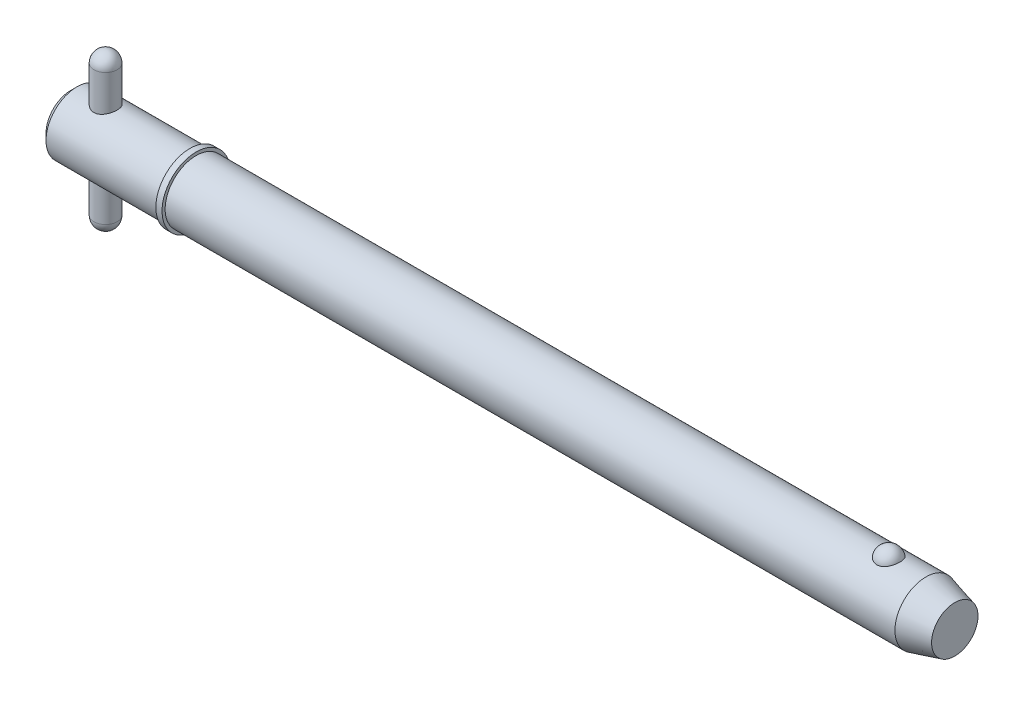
ISO-10303-21;
HEADER;
FILE_DESCRIPTION(('STEP AP214'),'2;1');
FILE_NAME('part.step','',(''),(''),'','','');
FILE_SCHEMA(('AUTOMOTIVE_DESIGN { 1 0 10303 214 1 1 1 1 }'));
ENDSEC;
DATA;
#1=APPLICATION_CONTEXT('core data for automotive mechanical design processes');
#2=APPLICATION_PROTOCOL_DEFINITION('international standard','automotive_design',2000,#1);
#3=PRODUCT_CONTEXT('',#1,'mechanical');
#4=PRODUCT('Part','Part','',(#3));
#5=PRODUCT_RELATED_PRODUCT_CATEGORY('part','',(#4));
#6=PRODUCT_DEFINITION_FORMATION('','',#4);
#7=PRODUCT_DEFINITION_CONTEXT('part definition',#1,'design');
#8=PRODUCT_DEFINITION('design','',#6,#7);
#9=PRODUCT_DEFINITION_SHAPE('','',#8);
#10=(LENGTH_UNIT() NAMED_UNIT(*) SI_UNIT(.MILLI.,.METRE.));
#11=(NAMED_UNIT(*) PLANE_ANGLE_UNIT() SI_UNIT($,.RADIAN.));
#12=(NAMED_UNIT(*) SI_UNIT($,.STERADIAN.) SOLID_ANGLE_UNIT());
#13=UNCERTAINTY_MEASURE_WITH_UNIT(LENGTH_MEASURE(1.E-05),#10,'distance_accuracy_value','');
#14=(GEOMETRIC_REPRESENTATION_CONTEXT(3) GLOBAL_UNCERTAINTY_ASSIGNED_CONTEXT((#13)) GLOBAL_UNIT_ASSIGNED_CONTEXT((#10,
#11,#12)) REPRESENTATION_CONTEXT('',''));
#15=CARTESIAN_POINT('',(0.,0.,0.));
#16=DIRECTION('',(0.,0.,1.));
#17=DIRECTION('',(1.,0.,0.));
#18=AXIS2_PLACEMENT_3D('',#15,#16,#17);
#19=CARTESIAN_POINT('',(7.14,15.875,0.));
#20=DIRECTION('',(0.,-1.,0.));
#21=DIRECTION('',(0.,0.,-1.));
#22=AXIS2_PLACEMENT_3D('',#19,#20,#21);
#23=CYLINDRICAL_SURFACE('',#22,2.38);
#24=CARTESIAN_POINT('',(7.14,-13.495,0.));
#25=DIRECTION('',(0.,-1.,0.));
#26=DIRECTION('',(0.,0.,-1.));
#27=AXIS2_PLACEMENT_3D('',#24,#25,#26);
#28=CIRCLE('',#27,2.38);
#29=CARTESIAN_POINT('',(7.14,-13.495,-2.38));
#30=VERTEX_POINT('',#29);
#31=EDGE_CURVE('P0_E10',#30,#30,#28,.F.);
#32=ORIENTED_EDGE('',*,*,#31,.T.);
#33=EDGE_LOOP('',(#32));
#34=FACE_BOUND('',#33,.T.);
#35=CARTESIAN_POINT('',(7.14,13.495,0.));
#36=DIRECTION('',(0.,-1.,0.));
#37=DIRECTION('',(0.,0.,-1.));
#38=AXIS2_PLACEMENT_3D('',#35,#36,#37);
#39=CIRCLE('',#38,2.38);
#40=CARTESIAN_POINT('',(7.14,13.495,-2.38));
#41=VERTEX_POINT('',#40);
#42=EDGE_CURVE('P0_E21',#41,#41,#39,.T.);
#43=ORIENTED_EDGE('',*,*,#42,.T.);
#44=EDGE_LOOP('',(#43));
#45=FACE_BOUND('',#44,.T.);
#46=ADVANCED_FACE('P0_F14',(#34,#45),#23,.T.);
#47=CARTESIAN_POINT('',(7.14,-13.495,0.));
#48=DIRECTION('',(0.,0.,1.));
#49=DIRECTION('',(1.,0.,0.));
#50=AXIS2_PLACEMENT_3D('',#47,#48,#49);
#51=SPHERICAL_SURFACE('',#50,2.38);
#52=CARTESIAN_POINT('',(7.14,-13.495,0.));
#53=DIRECTION('',(0.,-1.,0.));
#54=DIRECTION('',(0.,0.,-1.));
#55=AXIS2_PLACEMENT_3D('',#52,#53,#54);
#56=SPHERICAL_SURFACE('',#55,2.38);
#57=ORIENTED_EDGE('',*,*,#31,.F.);
#58=EDGE_LOOP('',(#57));
#59=FACE_BOUND('',#58,.T.);
#60=ADVANCED_FACE('P0_F29',(#59),#56,.T.);
#61=CARTESIAN_POINT('',(7.14,13.495,0.));
#62=DIRECTION('',(0.,0.,1.));
#63=DIRECTION('',(1.,0.,0.));
#64=AXIS2_PLACEMENT_3D('',#61,#62,#63);
#65=SPHERICAL_SURFACE('',#64,2.38);
#66=CARTESIAN_POINT('',(7.14,13.495,0.));
#67=DIRECTION('',(0.,-1.,0.));
#68=DIRECTION('',(0.,0.,-1.));
#69=AXIS2_PLACEMENT_3D('',#66,#67,#68);
#70=SPHERICAL_SURFACE('',#69,2.38);
#71=ORIENTED_EDGE('',*,*,#42,.F.);
#72=EDGE_LOOP('',(#71));
#73=FACE_BOUND('',#72,.T.);
#74=ADVANCED_FACE('P0_F16',(#73),#70,.T.);
#75=CLOSED_SHELL('',(#46,#60,#74));
#76=MANIFOLD_SOLID_BREP('P0_B1',#75);
#77=CARTESIAN_POINT('',(0.,0.,0.));
#78=DIRECTION('',(1.,0.,0.));
#79=DIRECTION('',(0.,0.,-1.));
#80=AXIS2_PLACEMENT_3D('',#77,#78,#79);
#81=CYLINDRICAL_SURFACE('',#80,6.35);
#82=CARTESIAN_POINT('',(175.355369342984,0.,0.));
#83=DIRECTION('',(1.,0.,0.));
#84=DIRECTION('',(0.,0.,-1.));
#85=AXIS2_PLACEMENT_3D('',#82,#83,#84);
#86=CIRCLE('',#85,6.35);
#87=CARTESIAN_POINT('',(175.355369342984,0.,-6.35));
#88=VERTEX_POINT('',#87);
#89=EDGE_CURVE('P1_E81',#88,#88,#86,.T.);
#90=ORIENTED_EDGE('',*,*,#89,.F.);
#91=EDGE_LOOP('',(#90));
#92=FACE_BOUND('',#91,.T.);
#93=CARTESIAN_POINT('',(25.7,0.,0.));
#94=DIRECTION('',(1.,0.,0.));
#95=DIRECTION('',(0.,0.,-1.));
#96=AXIS2_PLACEMENT_3D('',#93,#94,#95);
#97=CIRCLE('',#96,6.35);
#98=CARTESIAN_POINT('',(25.7,0.,-6.35));
#99=VERTEX_POINT('',#98);
#100=EDGE_CURVE('P1_E85',#99,#99,#97,.T.);
#101=ORIENTED_EDGE('',*,*,#100,.T.);
#102=EDGE_LOOP('',(#101));
#103=FACE_BOUND('',#102,.T.);
#104=CARTESIAN_POINT('',(167.730021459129,5.87502187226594,2.40969251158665));
#105=CARTESIAN_POINT('',(167.605030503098,5.87501645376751,2.40969773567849));
#106=CARTESIAN_POINT('',(167.480080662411,5.87916061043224,2.39967292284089));
#107=CARTESIAN_POINT('',(167.233909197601,5.89523112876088,2.35991730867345));
#108=CARTESIAN_POINT('',(167.112686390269,5.90715499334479,2.33019283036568));
#109=CARTESIAN_POINT('',(166.877517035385,5.93739567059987,2.25201402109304));
#110=CARTESIAN_POINT('',(166.763560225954,5.95570321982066,2.20358681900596));
#111=CARTESIAN_POINT('',(166.54557352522,5.99672067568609,2.08937987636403));
#112=CARTESIAN_POINT('',(166.441545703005,6.0194314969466,2.02359652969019));
#113=CARTESIAN_POINT('',(166.242943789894,6.06760647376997,1.87428969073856));
#114=CARTESIAN_POINT('',(166.148726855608,6.09313095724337,1.79031110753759));
#115=CARTESIAN_POINT('',(165.975255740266,6.14375873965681,1.6080017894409));
#116=CARTESIAN_POINT('',(165.896004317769,6.16886196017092,1.50966841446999));
#117=CARTESIAN_POINT('',(165.750845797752,6.21724600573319,1.29645884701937));
#118=CARTESIAN_POINT('',(165.685688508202,6.24039621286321,1.18104158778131));
#119=CARTESIAN_POINT('',(165.574703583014,6.28117277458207,0.940351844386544));
#120=CARTESIAN_POINT('',(165.528877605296,6.29879865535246,0.815078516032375));
#121=CARTESIAN_POINT('',(165.457023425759,6.32692073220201,0.556494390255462));
#122=CARTESIAN_POINT('',(165.431249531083,6.33732517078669,0.423102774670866));
#123=CARTESIAN_POINT('',(165.400988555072,6.34957673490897,0.153542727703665));
#124=CARTESIAN_POINT('',(165.396500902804,6.35142408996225,0.0173743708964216));
#125=CARTESIAN_POINT('',(165.408865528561,6.34638925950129,-0.253036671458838));
#126=CARTESIAN_POINT('',(165.425594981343,6.33955731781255,-0.387285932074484));
#127=CARTESIAN_POINT('',(165.479843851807,6.31794129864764,-0.650851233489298));
#128=CARTESIAN_POINT('',(165.517363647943,6.3031570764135,-0.780167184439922));
#129=CARTESIAN_POINT('',(165.612500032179,6.26711642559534,-1.03041949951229));
#130=CARTESIAN_POINT('',(165.670143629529,6.24585130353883,-1.15134433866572));
#131=CARTESIAN_POINT('',(165.804352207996,6.19905619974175,-1.38129800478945));
#132=CARTESIAN_POINT('',(165.880918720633,6.17352587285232,-1.49032586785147));
#133=CARTESIAN_POINT('',(166.051753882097,6.12080227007,-1.69393164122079));
#134=CARTESIAN_POINT('',(166.146100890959,6.09360200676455,-1.78844209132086));
#135=CARTESIAN_POINT('',(166.350119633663,6.04070434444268,-1.95970536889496));
#136=CARTESIAN_POINT('',(166.459790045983,6.015006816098,-2.0364597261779));
#137=CARTESIAN_POINT('',(166.689187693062,5.96867714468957,-2.16845644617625));
#138=CARTESIAN_POINT('',(166.808652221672,5.94794910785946,-2.22412062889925));
#139=CARTESIAN_POINT('',(167.056218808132,5.91340580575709,-2.31440992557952));
#140=CARTESIAN_POINT('',(167.184317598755,5.89958794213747,-2.34904294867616));
#141=CARTESIAN_POINT('',(167.438582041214,5.88111049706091,-2.39491590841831));
#142=CARTESIAN_POINT('',(167.564520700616,5.87602512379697,-2.40724512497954));
#143=CARTESIAN_POINT('',(167.816786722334,5.87428980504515,-2.41147867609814));
#144=CARTESIAN_POINT('',(167.943114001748,5.8776381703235,-2.40338710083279));
#145=CARTESIAN_POINT('',(168.188417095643,5.89212921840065,-2.36762715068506));
#146=CARTESIAN_POINT('',(168.307499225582,5.90302431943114,-2.3405803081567));
#147=CARTESIAN_POINT('',(168.53924472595,5.93113752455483,-2.26839066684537));
#148=CARTESIAN_POINT('',(168.651907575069,5.94835614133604,-2.22324640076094));
#149=CARTESIAN_POINT('',(168.870400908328,5.9877301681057,-2.11493806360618));
#150=CARTESIAN_POINT('',(168.976028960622,6.00998499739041,-2.05140269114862));
#151=CARTESIAN_POINT('',(169.175300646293,6.05690144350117,-1.90842705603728));
#152=CARTESIAN_POINT('',(169.268941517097,6.08156361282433,-1.82898313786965));
#153=CARTESIAN_POINT('',(169.446675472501,6.13211715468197,-1.65182429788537));
#154=CARTESIAN_POINT('',(169.530055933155,6.15800825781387,-1.5533938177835));
#155=CARTESIAN_POINT('',(169.679790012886,6.20712834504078,-1.34374214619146));
#156=CARTESIAN_POINT('',(169.746140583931,6.23035685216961,-1.23251867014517));
#157=CARTESIAN_POINT('',(169.862345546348,6.27251177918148,-0.996447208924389));
#158=CARTESIAN_POINT('',(169.911607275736,6.29127762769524,-0.871278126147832));
#159=CARTESIAN_POINT('',(169.989614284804,6.3215862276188,-0.613870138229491));
#160=CARTESIAN_POINT('',(170.018359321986,6.33312889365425,-0.481631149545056));
#161=CARTESIAN_POINT('',(170.05477058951,6.34782349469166,-0.213672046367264));
#162=CARTESIAN_POINT('',(170.062413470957,6.35096613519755,-0.0779482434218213));
#163=CARTESIAN_POINT('',(170.056395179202,6.34851322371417,0.192943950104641));
#164=CARTESIAN_POINT('',(170.042734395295,6.3429178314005,0.328112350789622));
#165=CARTESIAN_POINT('',(169.99450361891,6.32360512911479,0.593406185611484));
#166=CARTESIAN_POINT('',(169.960031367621,6.30992579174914,0.723552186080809));
#167=CARTESIAN_POINT('',(169.870953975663,6.27586325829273,0.97583417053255));
#168=CARTESIAN_POINT('',(169.81634761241,6.25547965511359,1.09796966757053));
#169=CARTESIAN_POINT('',(169.68775879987,6.20998183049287,1.33148921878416));
#170=CARTESIAN_POINT('',(169.613674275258,6.18484288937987,1.44281227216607));
#171=CARTESIAN_POINT('',(169.447820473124,6.13258735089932,1.65087683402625));
#172=CARTESIAN_POINT('',(169.356051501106,6.10547078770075,1.7476185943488));
#173=CARTESIAN_POINT('',(169.157183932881,6.05235879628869,1.92350926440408));
#174=CARTESIAN_POINT('',(169.050133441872,6.02636017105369,2.00271146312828));
#175=CARTESIAN_POINT('',(168.823138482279,5.97843747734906,2.14154159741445));
#176=CARTESIAN_POINT('',(168.703191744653,5.9565141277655,2.20116608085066));
#177=CARTESIAN_POINT('',(168.444523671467,5.91812106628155,2.30250570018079));
#178=CARTESIAN_POINT('',(168.30506980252,5.90217533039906,2.34256795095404));
#179=CARTESIAN_POINT('',(168.020397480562,5.88063128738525,2.3961521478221));
#180=CARTESIAN_POINT('',(167.87518174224,5.87502816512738,2.40968644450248));
#181=CARTESIAN_POINT('',(167.730021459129,5.87502187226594,2.40969251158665));
#182=B_SPLINE_CURVE_WITH_KNOTS('',3,(#104,#105,#106,#107,#108,#109,#110,#111,#112,#113,#114,
#115,#116,#117,#118,#119,#120,#121,#122,#123,#124,#125,#126,#127,#128,#129,#130,#131,#132,#133,
#134,#135,#136,#137,#138,#139,#140,#141,#142,#143,#144,#145,#146,#147,#148,#149,#150,#151,#152,
#153,#154,#155,#156,#157,#158,#159,#160,#161,#162,#163,#164,#165,#166,#167,#168,#169,#170,#171,
#172,#173,#174,#175,#176,#177,#178,#179,#180,#181),.UNSPECIFIED.,.T.,.F.,(4,2,2,2,2,2,2,2,2,2,2,
2,2,2,2,2,2,2,2,2,2,2,2,2,2,2,2,2,2,2,2,2,2,2,2,2,2,2,4),(0.,0.374440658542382,
0.748761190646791,1.122540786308,1.4963981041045,1.88098871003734,2.26565013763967,
2.66741104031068,3.06920639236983,3.47601794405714,3.88281858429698,4.28727498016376,
4.69173873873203,5.09674745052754,5.50178895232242,5.90865911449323,6.31549420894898,
6.71369855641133,7.11175305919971,7.48978077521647,7.86773278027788,8.23383886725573,
8.59997464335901,8.97409044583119,9.34829231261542,9.74122667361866,10.1342313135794,
10.5397522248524,10.9452779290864,11.3512521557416,11.75721896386,12.1612938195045,
12.5653932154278,12.9716540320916,13.3779078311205,13.7829098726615,14.1879832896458,
14.6230486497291,15.0579114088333),.UNSPECIFIED.);
#183=CARTESIAN_POINT('',(167.730021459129,5.87502187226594,2.40969251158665));
#184=VERTEX_POINT('',#183);
#185=EDGE_CURVE('P1_E35',#184,#184,#182,.T.);
#186=ORIENTED_EDGE('',*,*,#185,.T.);
#187=EDGE_LOOP('',(#186));
#188=FACE_BOUND('',#187,.T.);
#189=ADVANCED_FACE('P1_F13',(#92,#103,#188),#81,.T.);
#190=CARTESIAN_POINT('',(0.,0.,0.));
#191=DIRECTION('',(-1.,0.,0.));
#192=DIRECTION('',(0.,0.,1.));
#193=AXIS2_PLACEMENT_3D('',#190,#191,#192);
#194=PLANE('',#193);
#195=CARTESIAN_POINT('',(0.,0.,0.));
#196=DIRECTION('',(1.,0.,0.));
#197=DIRECTION('',(0.,0.,-1.));
#198=AXIS2_PLACEMENT_3D('',#195,#196,#197);
#199=CIRCLE('',#198,5.08);
#200=CARTESIAN_POINT('',(0.,0.,-5.08));
#201=VERTEX_POINT('',#200);
#202=EDGE_CURVE('P1_E9',#201,#201,#199,.T.);
#203=ORIENTED_EDGE('',*,*,#202,.F.);
#204=EDGE_LOOP('',(#203));
#205=FACE_BOUND('',#204,.T.);
#206=ADVANCED_FACE('P1_F15',(#205),#194,.T.);
#207=CARTESIAN_POINT('',(1.27,0.,0.));
#208=DIRECTION('',(1.,0.,0.));
#209=DIRECTION('',(0.,0.,-1.));
#210=AXIS2_PLACEMENT_3D('',#207,#208,#209);
#211=CONICAL_SURFACE('',#210,6.35,0.78539816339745);
#212=ORIENTED_EDGE('',*,*,#202,.T.);
#213=EDGE_LOOP('',(#212));
#214=FACE_BOUND('',#213,.T.);
#215=CARTESIAN_POINT('',(1.27,0.,0.));
#216=DIRECTION('',(1.,0.,0.));
#217=DIRECTION('',(0.,0.,-1.));
#218=AXIS2_PLACEMENT_3D('',#215,#216,#217);
#219=CIRCLE('',#218,6.35);
#220=CARTESIAN_POINT('',(1.27,0.,-6.35));
#221=VERTEX_POINT('',#220);
#222=EDGE_CURVE('P1_E26',#221,#221,#219,.T.);
#223=ORIENTED_EDGE('',*,*,#222,.F.);
#224=EDGE_LOOP('',(#223));
#225=FACE_BOUND('',#224,.T.);
#226=ADVANCED_FACE('P1_F77',(#214,#225),#211,.T.);
#227=CARTESIAN_POINT('',(0.,0.,0.));
#228=DIRECTION('',(1.,0.,0.));
#229=DIRECTION('',(0.,0.,-1.));
#230=AXIS2_PLACEMENT_3D('',#227,#228,#229);
#231=CYLINDRICAL_SURFACE('',#230,6.35);
#232=CARTESIAN_POINT('',(7.14,-5.88711304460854,2.38));
#233=CARTESIAN_POINT('',(7.01146258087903,-5.88710856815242,2.38000480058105));
#234=CARTESIAN_POINT('',(6.88295682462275,-5.89136840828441,2.36955244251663));
#235=CARTESIAN_POINT('',(6.62981934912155,-5.90782785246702,2.32820953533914));
#236=CARTESIAN_POINT('',(6.50518751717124,-5.92002722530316,2.29731958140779));
#237=CARTESIAN_POINT('',(6.26352403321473,-5.95079384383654,2.21639366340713));
#238=CARTESIAN_POINT('',(6.14647496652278,-5.96934583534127,2.16640353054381));
#239=CARTESIAN_POINT('',(5.92237941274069,-6.01070278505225,2.04885862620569));
#240=CARTESIAN_POINT('',(5.81533593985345,-6.03350901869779,1.98129858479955));
#241=CARTESIAN_POINT('',(5.60897525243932,-6.08207341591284,1.82693902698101));
#242=CARTESIAN_POINT('',(5.51022503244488,-6.10791836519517,1.73940861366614));
#243=CARTESIAN_POINT('',(5.32840561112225,-6.15892405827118,1.54914379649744));
#244=CARTESIAN_POINT('',(5.24533975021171,-6.1840846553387,1.44640616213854));
#245=CARTESIAN_POINT('',(5.09451639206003,-6.23191821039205,1.22434014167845));
#246=CARTESIAN_POINT('',(5.02737511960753,-6.25447755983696,1.10456656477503));
#247=CARTESIAN_POINT('',(4.91443001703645,-6.2935236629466,0.854429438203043));
#248=CARTESIAN_POINT('',(4.86861879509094,-6.31001251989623,0.724069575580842));
#249=CARTESIAN_POINT('',(4.80162253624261,-6.33444370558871,0.46242122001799));
#250=CARTESIAN_POINT('',(4.77946137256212,-6.34272370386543,0.331414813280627));
#251=CARTESIAN_POINT('',(4.75726677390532,-6.35101600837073,0.0672982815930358));
#252=CARTESIAN_POINT('',(4.75722615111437,-6.35103100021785,-0.0658111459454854));
#253=CARTESIAN_POINT('',(4.77870510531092,-6.3430064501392,-0.323358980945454));
#254=CARTESIAN_POINT('',(4.79915922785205,-6.33536494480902,-0.447900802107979));
#255=CARTESIAN_POINT('',(4.85925493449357,-6.31340794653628,-0.69163609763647));
#256=CARTESIAN_POINT('',(4.89889787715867,-6.29909198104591,-0.810829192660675));
#257=CARTESIAN_POINT('',(4.9967414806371,-6.26494471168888,-1.04254212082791));
#258=CARTESIAN_POINT('',(5.05520370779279,-6.24503620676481,-1.1549396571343));
#259=CARTESIAN_POINT('',(5.1887948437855,-6.20171869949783,-1.3686079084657));
#260=CARTESIAN_POINT('',(5.26392912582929,-6.17830856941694,-1.46987502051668));
#261=CARTESIAN_POINT('',(5.43386591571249,-6.12878580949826,-1.66468415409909));
#262=CARTESIAN_POINT('',(5.52956139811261,-6.10259519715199,-1.75742857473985));
#263=CARTESIAN_POINT('',(5.73530435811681,-6.05155777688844,-1.92585331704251));
#264=CARTESIAN_POINT('',(5.84535542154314,-6.02671130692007,-2.00152936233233));
#265=CARTESIAN_POINT('',(6.07982989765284,-5.98068420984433,-2.13519109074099));
#266=CARTESIAN_POINT('',(6.20451768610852,-5.95959698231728,-2.19274775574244));
#267=CARTESIAN_POINT('',(6.4628145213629,-5.92455622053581,-2.28574558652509));
#268=CARTESIAN_POINT('',(6.59641856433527,-5.91059872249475,-2.32119904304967));
#269=CARTESIAN_POINT('',(6.86087441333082,-5.8923327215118,-2.36717069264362));
#270=CARTESIAN_POINT('',(6.99147192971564,-5.8875347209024,-2.37895573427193));
#271=CARTESIAN_POINT('',(7.25283805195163,-5.88674545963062,-2.38091046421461));
#272=CARTESIAN_POINT('',(7.38360660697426,-5.89075200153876,-2.37108554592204));
#273=CARTESIAN_POINT('',(7.63510696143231,-5.90662331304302,-2.33124781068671));
#274=CARTESIAN_POINT('',(7.75602069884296,-5.91810660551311,-2.30221396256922));
#275=CARTESIAN_POINT('',(7.99120505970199,-5.94718527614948,-2.22601401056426));
#276=CARTESIAN_POINT('',(8.10547431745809,-5.96478190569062,-2.17884419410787));
#277=CARTESIAN_POINT('',(8.32888632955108,-6.00491533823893,-2.06572311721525));
#278=CARTESIAN_POINT('',(8.43767672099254,-6.02761250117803,-1.99913452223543));
#279=CARTESIAN_POINT('',(8.6429894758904,-6.07511988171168,-1.84974438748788));
#280=CARTESIAN_POINT('',(8.73950733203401,-6.09993087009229,-1.76693691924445));
#281=CARTESIAN_POINT('',(8.9238741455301,-6.1507686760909,-1.58125563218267));
#282=CARTESIAN_POINT('',(9.01078732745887,-6.17677301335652,-1.47744327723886));
#283=CARTESIAN_POINT('',(9.16607127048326,-6.22556172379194,-1.25606967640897));
#284=CARTESIAN_POINT('',(9.23444197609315,-6.24834608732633,-1.13850838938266));
#285=CARTESIAN_POINT('',(9.3502493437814,-6.28811144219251,-0.893050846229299));
#286=CARTESIAN_POINT('',(9.39775808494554,-6.30511236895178,-0.765192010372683));
#287=CARTESIAN_POINT('',(9.47032640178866,-6.33145833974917,-0.502514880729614));
#288=CARTESIAN_POINT('',(9.49539651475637,-6.34080697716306,-0.367699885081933));
#289=CARTESIAN_POINT('',(9.52124059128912,-6.35045496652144,-0.103396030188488));
#290=CARTESIAN_POINT('',(9.52334421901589,-6.35124952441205,0.025945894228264));
#291=CARTESIAN_POINT('',(9.50661518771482,-6.34499064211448,0.283061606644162));
#292=CARTESIAN_POINT('',(9.48778504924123,-6.33793814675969,0.410835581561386));
#293=CARTESIAN_POINT('',(9.43065630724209,-6.31700307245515,0.658028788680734));
#294=CARTESIAN_POINT('',(9.39284291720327,-6.30329098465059,0.7775756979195));
#295=CARTESIAN_POINT('',(9.29930406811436,-6.27046903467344,1.00863789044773));
#296=CARTESIAN_POINT('',(9.2435752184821,-6.25135815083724,1.12015164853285));
#297=CARTESIAN_POINT('',(9.11312349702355,-6.20865254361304,1.33711407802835));
#298=CARTESIAN_POINT('',(9.03770094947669,-6.18490316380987,1.44211105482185));
#299=CARTESIAN_POINT('',(8.87110640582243,-6.13583718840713,1.63836897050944));
#300=CARTESIAN_POINT('',(8.77992879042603,-6.11052003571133,1.72962498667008));
#301=CARTESIAN_POINT('',(8.57869799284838,-6.05953829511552,1.90076098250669));
#302=CARTESIAN_POINT('',(8.46790320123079,-6.03392573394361,1.97978778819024));
#303=CARTESIAN_POINT('',(8.23379693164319,-5.98676607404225,2.11813466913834));
#304=CARTESIAN_POINT('',(8.11048418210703,-5.9652193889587,2.17745273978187));
#305=CARTESIAN_POINT('',(7.84900037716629,-5.92818393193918,2.27641807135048));
#306=CARTESIAN_POINT('',(7.71041678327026,-5.91299857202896,2.31510015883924));
#307=CARTESIAN_POINT('',(7.42787316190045,-5.89246887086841,2.36688002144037));
#308=CARTESIAN_POINT('',(7.28391673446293,-5.88711805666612,2.37999462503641));
#309=CARTESIAN_POINT('',(7.14,-5.88711304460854,2.38));
#310=B_SPLINE_CURVE_WITH_KNOTS('',3,(#232,#233,#234,#235,#236,#237,#238,#239,#240,#241,#242,
#243,#244,#245,#246,#247,#248,#249,#250,#251,#252,#253,#254,#255,#256,#257,#258,#259,#260,#261,
#262,#263,#264,#265,#266,#267,#268,#269,#270,#271,#272,#273,#274,#275,#276,#277,#278,#279,#280,
#281,#282,#283,#284,#285,#286,#287,#288,#289,#290,#291,#292,#293,#294,#295,#296,#297,#298,#299,
#300,#301,#302,#303,#304,#305,#306,#307,#308,#309),.UNSPECIFIED.,.T.,.F.,(4,2,2,2,2,2,2,2,2,2,2,
2,2,2,2,2,2,2,2,2,2,2,2,2,2,2,2,2,2,2,2,2,2,2,2,2,2,2,4),(0.,0.385076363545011,
0.770141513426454,1.15428843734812,1.53855071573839,1.94016118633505,2.3418570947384,
2.75720522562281,3.1724093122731,3.569721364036,3.96690431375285,4.34445758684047,
4.72203759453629,5.10511017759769,5.48830640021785,5.89390240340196,6.29959991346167,
6.71428455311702,7.12873839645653,7.52034494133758,7.91185376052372,8.28480528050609,
8.65783318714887,9.0448340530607,9.43197664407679,9.84363087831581,10.2552863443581,
10.6655081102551,11.0755371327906,11.4616919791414,11.847800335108,12.224507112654,
12.6012852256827,12.9938941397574,13.386643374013,13.8000944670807,14.2135876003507,
14.6450218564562,15.0761720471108),.UNSPECIFIED.);
#311=CARTESIAN_POINT('',(7.14,-5.88711304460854,2.38));
#312=VERTEX_POINT('',#311);
#313=EDGE_CURVE('P1_E17',#312,#312,#310,.T.);
#314=ORIENTED_EDGE('',*,*,#313,.F.);
#315=EDGE_LOOP('',(#314));
#316=FACE_BOUND('',#315,.T.);
#317=CARTESIAN_POINT('',(7.14,5.88711304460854,2.38));
#318=CARTESIAN_POINT('',(7.26853741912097,5.88710856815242,2.38000480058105));
#319=CARTESIAN_POINT('',(7.39704317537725,5.89136840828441,2.36955244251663));
#320=CARTESIAN_POINT('',(7.65018065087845,5.90782785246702,2.32820953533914));
#321=CARTESIAN_POINT('',(7.77481248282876,5.92002722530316,2.29731958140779));
#322=CARTESIAN_POINT('',(8.01647596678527,5.95079384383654,2.21639366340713));
#323=CARTESIAN_POINT('',(8.13352503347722,5.96934583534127,2.16640353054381));
#324=CARTESIAN_POINT('',(8.35762058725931,6.01070278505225,2.04885862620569));
#325=CARTESIAN_POINT('',(8.46466406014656,6.03350901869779,1.98129858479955));
#326=CARTESIAN_POINT('',(8.67102474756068,6.08207341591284,1.82693902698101));
#327=CARTESIAN_POINT('',(8.76977496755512,6.10791836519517,1.73940861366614));
#328=CARTESIAN_POINT('',(8.95159438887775,6.15892405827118,1.54914379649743));
#329=CARTESIAN_POINT('',(9.03466024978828,6.1840846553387,1.44640616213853));
#330=CARTESIAN_POINT('',(9.18548360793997,6.23191821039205,1.22434014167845));
#331=CARTESIAN_POINT('',(9.25262488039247,6.25447755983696,1.10456656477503));
#332=CARTESIAN_POINT('',(9.36556998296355,6.2935236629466,0.854429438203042));
#333=CARTESIAN_POINT('',(9.41138120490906,6.31001251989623,0.72406957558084));
#334=CARTESIAN_POINT('',(9.47837746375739,6.33444370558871,0.462421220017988));
#335=CARTESIAN_POINT('',(9.50053862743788,6.34272370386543,0.331414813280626));
#336=CARTESIAN_POINT('',(9.52273322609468,6.35101600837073,0.0672982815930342));
#337=CARTESIAN_POINT('',(9.52277384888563,6.35103100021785,-0.0658111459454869));
#338=CARTESIAN_POINT('',(9.50129489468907,6.3430064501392,-0.323358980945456));
#339=CARTESIAN_POINT('',(9.48084077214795,6.33536494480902,-0.447900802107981));
#340=CARTESIAN_POINT('',(9.42074506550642,6.31340794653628,-0.691636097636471));
#341=CARTESIAN_POINT('',(9.38110212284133,6.29909198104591,-0.810829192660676));
#342=CARTESIAN_POINT('',(9.2832585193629,6.26494471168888,-1.04254212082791));
#343=CARTESIAN_POINT('',(9.22479629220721,6.24503620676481,-1.1549396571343));
#344=CARTESIAN_POINT('',(9.0912051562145,6.20171869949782,-1.3686079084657));
#345=CARTESIAN_POINT('',(9.0160708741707,6.17830856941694,-1.46987502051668));
#346=CARTESIAN_POINT('',(8.84613408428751,6.12878580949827,-1.66468415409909));
#347=CARTESIAN_POINT('',(8.75043860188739,6.10259519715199,-1.75742857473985));
#348=CARTESIAN_POINT('',(8.54469564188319,6.05155777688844,-1.92585331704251));
#349=CARTESIAN_POINT('',(8.43464457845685,6.02671130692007,-2.00152936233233));
#350=CARTESIAN_POINT('',(8.20017010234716,5.98068420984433,-2.13519109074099));
#351=CARTESIAN_POINT('',(8.07548231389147,5.95959698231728,-2.19274775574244));
#352=CARTESIAN_POINT('',(7.8171854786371,5.9245562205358,-2.28574558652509));
#353=CARTESIAN_POINT('',(7.68358143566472,5.91059872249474,-2.32119904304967));
#354=CARTESIAN_POINT('',(7.41912558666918,5.8923327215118,-2.36717069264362));
#355=CARTESIAN_POINT('',(7.28852807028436,5.8875347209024,-2.37895573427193));
#356=CARTESIAN_POINT('',(7.02716194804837,5.88674545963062,-2.38091046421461));
#357=CARTESIAN_POINT('',(6.89639339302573,5.89075200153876,-2.37108554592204));
#358=CARTESIAN_POINT('',(6.64489303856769,5.90662331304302,-2.33124781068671));
#359=CARTESIAN_POINT('',(6.52397930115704,5.91810660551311,-2.30221396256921));
#360=CARTESIAN_POINT('',(6.288794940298,5.94718527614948,-2.22601401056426));
#361=CARTESIAN_POINT('',(6.17452568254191,5.96478190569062,-2.17884419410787));
#362=CARTESIAN_POINT('',(5.95111367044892,6.00491533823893,-2.06572311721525));
#363=CARTESIAN_POINT('',(5.84232327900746,6.02761250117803,-1.99913452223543));
#364=CARTESIAN_POINT('',(5.6370105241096,6.07511988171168,-1.84974438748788));
#365=CARTESIAN_POINT('',(5.54049266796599,6.09993087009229,-1.76693691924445));
#366=CARTESIAN_POINT('',(5.3561258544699,6.1507686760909,-1.58125563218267));
#367=CARTESIAN_POINT('',(5.26921267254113,6.17677301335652,-1.47744327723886));
#368=CARTESIAN_POINT('',(5.11392872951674,6.22556172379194,-1.25606967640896));
#369=CARTESIAN_POINT('',(5.04555802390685,6.24834608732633,-1.13850838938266));
#370=CARTESIAN_POINT('',(4.9297506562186,6.28811144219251,-0.893050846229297));
#371=CARTESIAN_POINT('',(4.88224191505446,6.30511236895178,-0.76519201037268));
#372=CARTESIAN_POINT('',(4.80967359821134,6.33145833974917,-0.502514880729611));
#373=CARTESIAN_POINT('',(4.78460348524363,6.34080697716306,-0.36769988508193));
#374=CARTESIAN_POINT('',(4.75875940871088,6.35045496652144,-0.103396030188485));
#375=CARTESIAN_POINT('',(4.75665578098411,6.35124952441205,0.025945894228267));
#376=CARTESIAN_POINT('',(4.77338481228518,6.34499064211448,0.283061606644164));
#377=CARTESIAN_POINT('',(4.79221495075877,6.33793814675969,0.410835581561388));
#378=CARTESIAN_POINT('',(4.84934369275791,6.31700307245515,0.658028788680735));
#379=CARTESIAN_POINT('',(4.88715708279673,6.30329098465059,0.777575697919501));
#380=CARTESIAN_POINT('',(4.98069593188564,6.27046903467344,1.00863789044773));
#381=CARTESIAN_POINT('',(5.0364247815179,6.25135815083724,1.12015164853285));
#382=CARTESIAN_POINT('',(5.16687650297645,6.20865254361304,1.33711407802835));
#383=CARTESIAN_POINT('',(5.24229905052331,6.18490316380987,1.44211105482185));
#384=CARTESIAN_POINT('',(5.40889359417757,6.13583718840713,1.63836897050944));
#385=CARTESIAN_POINT('',(5.50007120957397,6.11052003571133,1.72962498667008));
#386=CARTESIAN_POINT('',(5.70130200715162,6.05953829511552,1.90076098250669));
#387=CARTESIAN_POINT('',(5.81209679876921,6.03392573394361,1.97978778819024));
#388=CARTESIAN_POINT('',(6.04620306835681,5.98676607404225,2.11813466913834));
#389=CARTESIAN_POINT('',(6.16951581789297,5.9652193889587,2.17745273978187));
#390=CARTESIAN_POINT('',(6.43099962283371,5.92818393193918,2.27641807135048));
#391=CARTESIAN_POINT('',(6.56958321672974,5.91299857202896,2.31510015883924));
#392=CARTESIAN_POINT('',(6.85212683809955,5.89246887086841,2.36688002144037));
#393=CARTESIAN_POINT('',(6.99608326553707,5.88711805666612,2.37999462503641));
#394=CARTESIAN_POINT('',(7.14,5.88711304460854,2.38));
#395=B_SPLINE_CURVE_WITH_KNOTS('',3,(#317,#318,#319,#320,#321,#322,#323,#324,#325,#326,#327,
#328,#329,#330,#331,#332,#333,#334,#335,#336,#337,#338,#339,#340,#341,#342,#343,#344,#345,#346,
#347,#348,#349,#350,#351,#352,#353,#354,#355,#356,#357,#358,#359,#360,#361,#362,#363,#364,#365,
#366,#367,#368,#369,#370,#371,#372,#373,#374,#375,#376,#377,#378,#379,#380,#381,#382,#383,#384,
#385,#386,#387,#388,#389,#390,#391,#392,#393,#394),.UNSPECIFIED.,.T.,.F.,(4,2,2,2,2,2,2,2,2,2,2,
2,2,2,2,2,2,2,2,2,2,2,2,2,2,2,2,2,2,2,2,2,2,2,2,2,2,2,4),(0.,0.385076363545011,
0.770141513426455,1.15428843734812,1.53855071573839,1.94016118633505,2.3418570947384,
2.75720522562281,3.1724093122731,3.56972136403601,3.96690431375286,4.34445758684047,
4.72203759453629,5.10511017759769,5.48830640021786,5.89390240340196,6.29959991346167,
6.71428455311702,7.12873839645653,7.52034494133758,7.91185376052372,8.2848052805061,
8.65783318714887,9.0448340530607,9.43197664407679,9.84363087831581,10.2552863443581,
10.6655081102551,11.0755371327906,11.4616919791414,11.847800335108,12.2245071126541,
12.6012852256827,12.9938941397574,13.386643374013,13.8000944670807,14.2135876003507,
14.6450218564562,15.0761720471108),.UNSPECIFIED.);
#396=CARTESIAN_POINT('',(7.14,5.88711304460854,2.38));
#397=VERTEX_POINT('',#396);
#398=EDGE_CURVE('P1_E43',#397,#397,#395,.T.);
#399=ORIENTED_EDGE('',*,*,#398,.F.);
#400=EDGE_LOOP('',(#399));
#401=FACE_BOUND('',#400,.T.);
#402=ORIENTED_EDGE('',*,*,#222,.T.);
#403=EDGE_LOOP('',(#402));
#404=FACE_BOUND('',#403,.T.);
#405=CARTESIAN_POINT('',(24.43,0.,0.));
#406=DIRECTION('',(1.,0.,0.));
#407=DIRECTION('',(0.,0.,-1.));
#408=AXIS2_PLACEMENT_3D('',#405,#406,#407);
#409=CIRCLE('',#408,6.35);
#410=CARTESIAN_POINT('',(24.43,0.,-6.35));
#411=VERTEX_POINT('',#410);
#412=EDGE_CURVE('P1_E31',#411,#411,#409,.T.);
#413=ORIENTED_EDGE('',*,*,#412,.F.);
#414=EDGE_LOOP('',(#413));
#415=FACE_BOUND('',#414,.T.);
#416=ADVANCED_FACE('P1_F103',(#316,#401,#404,#415),#231,.T.);
#417=CARTESIAN_POINT('',(24.43,6.35,0.));
#418=DIRECTION('',(-1.,0.,0.));
#419=DIRECTION('',(0.,0.,1.));
#420=AXIS2_PLACEMENT_3D('',#417,#418,#419);
#421=PLANE('',#420);
#422=ORIENTED_EDGE('',*,*,#412,.T.);
#423=EDGE_LOOP('',(#422));
#424=FACE_BOUND('',#423,.T.);
#425=CARTESIAN_POINT('',(24.43,0.,0.));
#426=DIRECTION('',(1.,0.,0.));
#427=DIRECTION('',(0.,0.,-1.));
#428=AXIS2_PLACEMENT_3D('',#425,#426,#427);
#429=CIRCLE('',#428,6.985);
#430=CARTESIAN_POINT('',(24.43,0.,-6.985));
#431=VERTEX_POINT('',#430);
#432=EDGE_CURVE('P1_E91',#431,#431,#429,.T.);
#433=ORIENTED_EDGE('',*,*,#432,.F.);
#434=EDGE_LOOP('',(#433));
#435=FACE_BOUND('',#434,.T.);
#436=ADVANCED_FACE('P1_F100',(#424,#435),#421,.T.);
#437=CARTESIAN_POINT('',(0.,0.,0.));
#438=DIRECTION('',(1.,0.,0.));
#439=DIRECTION('',(0.,0.,-1.));
#440=AXIS2_PLACEMENT_3D('',#437,#438,#439);
#441=CYLINDRICAL_SURFACE('',#440,6.985);
#442=ORIENTED_EDGE('',*,*,#432,.T.);
#443=EDGE_LOOP('',(#442));
#444=FACE_BOUND('',#443,.T.);
#445=CARTESIAN_POINT('',(25.7,0.,0.));
#446=DIRECTION('',(1.,0.,0.));
#447=DIRECTION('',(0.,0.,-1.));
#448=AXIS2_PLACEMENT_3D('',#445,#446,#447);
#449=CIRCLE('',#448,6.985);
#450=CARTESIAN_POINT('',(25.7,0.,-6.985));
#451=VERTEX_POINT('',#450);
#452=EDGE_CURVE('P1_E88',#451,#451,#449,.T.);
#453=ORIENTED_EDGE('',*,*,#452,.F.);
#454=EDGE_LOOP('',(#453));
#455=FACE_BOUND('',#454,.T.);
#456=ADVANCED_FACE('P1_F68',(#444,#455),#441,.T.);
#457=CARTESIAN_POINT('',(25.7,6.985,0.));
#458=DIRECTION('',(1.,0.,0.));
#459=DIRECTION('',(0.,0.,-1.));
#460=AXIS2_PLACEMENT_3D('',#457,#458,#459);
#461=PLANE('',#460);
#462=ORIENTED_EDGE('',*,*,#452,.T.);
#463=EDGE_LOOP('',(#462));
#464=FACE_BOUND('',#463,.T.);
#465=ORIENTED_EDGE('',*,*,#100,.F.);
#466=EDGE_LOOP('',(#465));
#467=FACE_BOUND('',#466,.T.);
#468=ADVANCED_FACE('P1_F62',(#464,#467),#461,.T.);
#469=CARTESIAN_POINT('',(181.28,0.,0.));
#470=DIRECTION('',(-1.,0.,0.));
#471=DIRECTION('',(0.,0.,1.));
#472=AXIS2_PLACEMENT_3D('',#469,#470,#471);
#473=CONICAL_SURFACE('',#472,4.76250000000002,0.261799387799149);
#474=ORIENTED_EDGE('',*,*,#89,.T.);
#475=EDGE_LOOP('',(#474));
#476=FACE_BOUND('',#475,.T.);
#477=CARTESIAN_POINT('',(181.28,0.,0.));
#478=DIRECTION('',(1.,0.,0.));
#479=DIRECTION('',(0.,0.,-1.));
#480=AXIS2_PLACEMENT_3D('',#477,#478,#479);
#481=CIRCLE('',#480,4.76250000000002);
#482=CARTESIAN_POINT('',(181.28,0.,-4.76250000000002));
#483=VERTEX_POINT('',#482);
#484=EDGE_CURVE('P1_E42',#483,#483,#481,.T.);
#485=ORIENTED_EDGE('',*,*,#484,.F.);
#486=EDGE_LOOP('',(#485));
#487=FACE_BOUND('',#486,.T.);
#488=ADVANCED_FACE('P1_F59',(#476,#487),#473,.T.);
#489=CARTESIAN_POINT('',(181.28,4.76250000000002,0.));
#490=DIRECTION('',(1.,0.,0.));
#491=DIRECTION('',(0.,0.,-1.));
#492=AXIS2_PLACEMENT_3D('',#489,#490,#491);
#493=PLANE('',#492);
#494=ORIENTED_EDGE('',*,*,#484,.T.);
#495=EDGE_LOOP('',(#494));
#496=FACE_BOUND('',#495,.T.);
#497=ADVANCED_FACE('P1_F55',(#496),#493,.T.);
#498=CARTESIAN_POINT('',(167.730021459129,5.715,0.));
#499=DIRECTION('',(-1.,0.,0.));
#500=DIRECTION('',(0.,1.,0.));
#501=AXIS2_PLACEMENT_3D('',#498,#499,#500);
#502=SPHERICAL_SURFACE('',#501,2.41500000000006);
#503=ORIENTED_EDGE('',*,*,#185,.F.);
#504=EDGE_LOOP('',(#503));
#505=FACE_BOUND('',#504,.T.);
#506=ADVANCED_FACE('P1_F50',(#505),#502,.T.);
#507=CARTESIAN_POINT('',(7.14,-6.985,0.));
#508=DIRECTION('',(0.,1.,0.));
#509=DIRECTION('',(0.,0.,1.));
#510=AXIS2_PLACEMENT_3D('',#507,#508,#509);
#511=CYLINDRICAL_SURFACE('',#510,2.38);
#512=ORIENTED_EDGE('',*,*,#313,.T.);
#513=EDGE_LOOP('',(#512));
#514=FACE_BOUND('',#513,.T.);
#515=ORIENTED_EDGE('',*,*,#398,.T.);
#516=EDGE_LOOP('',(#515));
#517=FACE_BOUND('',#516,.T.);
#518=ADVANCED_FACE('P1_F54',(#514,#517),#511,.F.);
#519=CLOSED_SHELL('',(#189,#206,#226,#416,#436,#456,#468,#488,#497,#506,#518));
#520=MANIFOLD_SOLID_BREP('P1_B1',#519);
#521=ADVANCED_BREP_SHAPE_REPRESENTATION('',(#18,#76,#520),#14);
#522=SHAPE_DEFINITION_REPRESENTATION(#9,#521);
ENDSEC;
END-ISO-10303-21;
